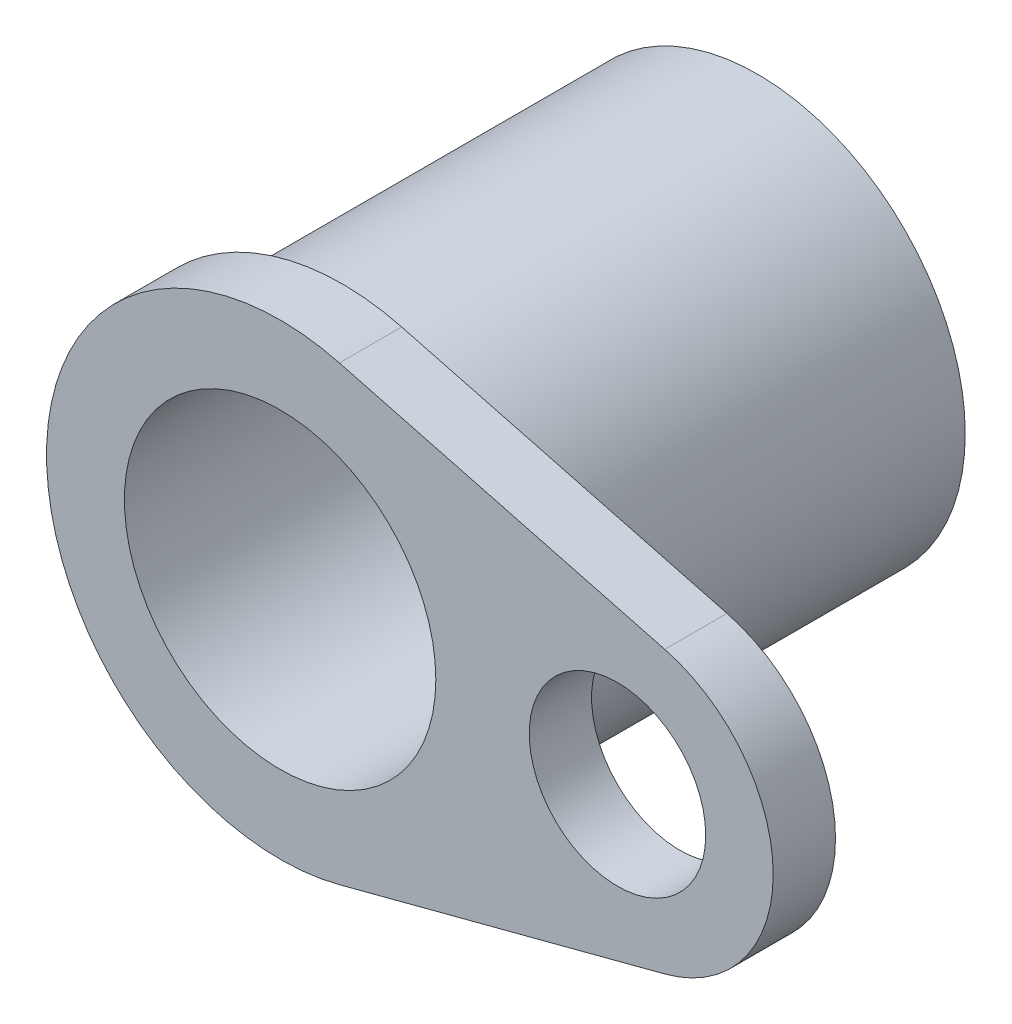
from build123d import *

# Parameters (mm, degrees)
SKETCH_1_R      = 4
SKETCH_1_R_2    = 3
EXTRUDE_1_DEPTH = 8
SKETCH_2_R      = 4
SKETCH_2_R_2    = 3
EXTRUDE_2_DEPTH = 1.2


with BuildPart() as part:
    # Sketch 1 → Extrude 1 (new body)
    with BuildSketch(Plane.XY):
        Circle(SKETCH_1_R)
        Circle(SKETCH_1_R_2, mode=Mode.SUBTRACT)
    extrude(amount=EXTRUDE_1_DEPTH)

    # Sketch 2 → Extrude 2 (add)
    # profile 1 of 2: a face of its own
    with BuildSketch(Plane.XY.offset(8)):
        with BuildLine():
            Line((7.410447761, 2.708369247), (1.141791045, 4.35273629))
            ThreePointArc((1.141791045, 4.35273629), (-2.748812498, 3.562868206), (-4.5, 0))
            ThreePointArc((-4.5, 0), (-2.748812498, -3.562868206), (1.141791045, -4.35273629))
            Line((1.141791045, -4.35273629), (7.410447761, -2.708369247))
            ThreePointArc((7.410447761, -2.708369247), (8.916895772, -1.710372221), (9.5, 0))
            ThreePointArc((9.5, 0), (8.916895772, 1.710372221), (7.410447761, 2.708369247))
        make_face()
        with BuildLine():
            ThreePointArc((4, 0), (0, -4), (-4, 0))
            ThreePointArc((-4, 0), (0, 4), (4, 0))
        make_face(mode=Mode.SUBTRACT)
        with BuildLine():
            ThreePointArc((4.8, 0), (6.5, 1.7), (8.2, 0))
            ThreePointArc((8.2, 0), (6.5, -1.7), (4.8, 0))
        make_face(mode=Mode.SUBTRACT)
    # profile 2 of 2: a face of its own
    with BuildSketch(Plane.XY.offset(8)):
        Circle(SKETCH_2_R)
        Circle(SKETCH_2_R_2, mode=Mode.SUBTRACT)
    extrude(amount=EXTRUDE_2_DEPTH)


solid = part.part
